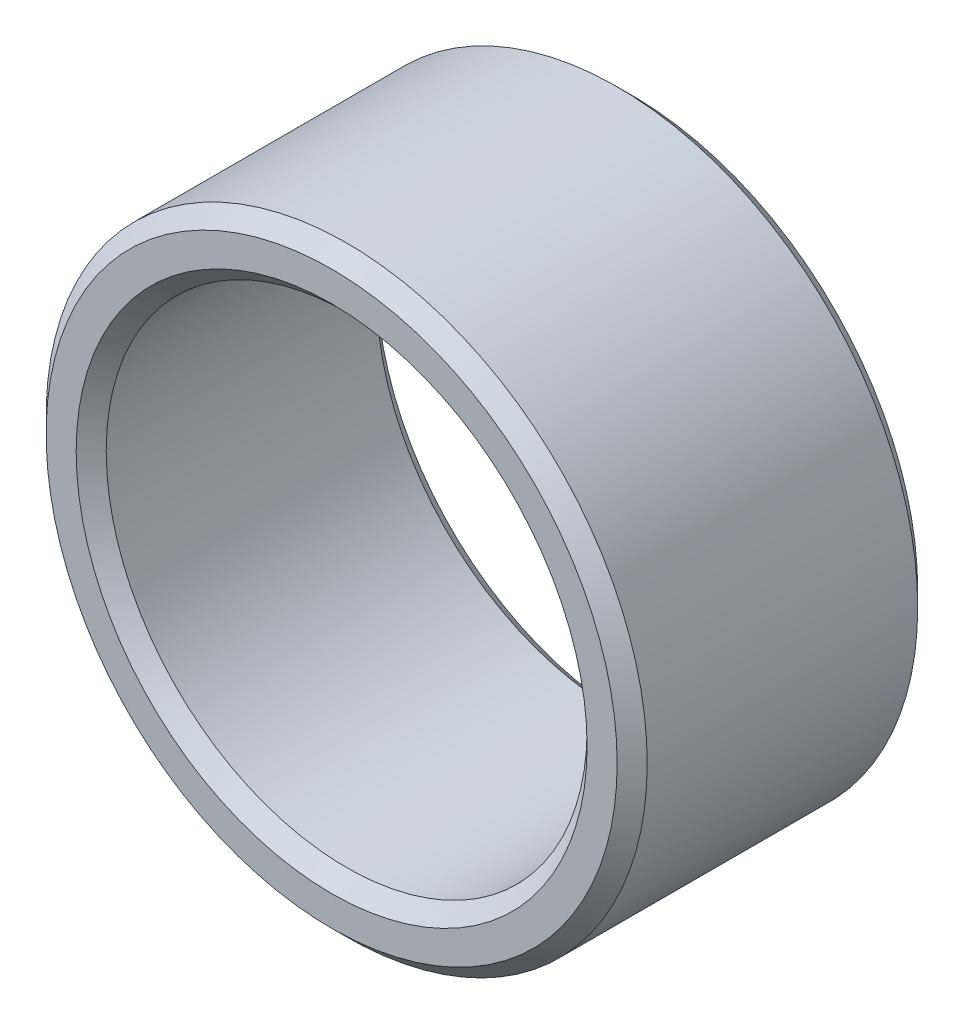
from build123d import *

# Parameters (mm, degrees)
ESQUISSE1_R        = 20
ESQUISSE1_R_2      = 16
BOSS_EXTRU_1_DEPTH = 20
CHANFREIN1_SIZE    = 1


with BuildPart() as part:
    # Esquisse1 → Boss.-Extru.1 (new body)
    with BuildSketch(Plane.XY):
        Circle(ESQUISSE1_R)
        Circle(ESQUISSE1_R_2, mode=Mode.SUBTRACT)
    extrude(amount=BOSS_EXTRU_1_DEPTH)

    # Chanfrein1
    chanfrein1_edges = [part.edges().sort_by_distance(p)[0] for p in [
        (-20, 0, 0),
        (-20, 0, 20),
        (-16, 0, 0),
        (-16, 0, 20),
    ]]
    chamfer(chanfrein1_edges, length=CHANFREIN1_SIZE)


solid = part.part
